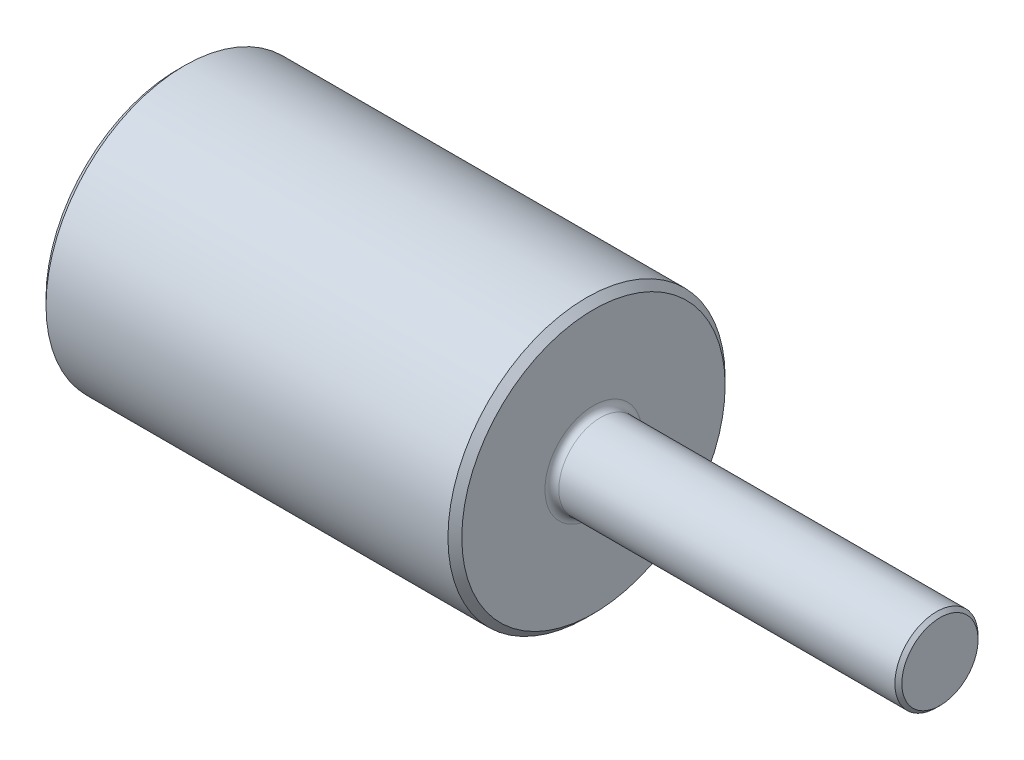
from build123d import *

# Parameters (mm, degrees)
CHANFREIN1_SIZE = 0.25
CHANFREIN3_SIZE = 0.5
CONG_1_R        = 0.5


with BuildPart() as part:
    # Esquisse1 → Base-R_volution (revolve)
    with BuildSketch(Plane.XY, mode=Mode.PRIVATE) as base_r_volution_sk:
        Polygon((0, 0), (0, 3), (-25, 3), (-25, 10), (-55, 10), (-55, 0), align=None)
    revolve(base_r_volution_sk.sketch.rotate(Axis((-58.669915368, 0, 0), (1, 0, 0)), 90), axis=Axis((-58.669915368, 0, 0), (1, 0, 0)))

    # Chanfrein1
    chanfrein1_edges = [part.edges().sort_by_distance(p)[0] for p in [
        (0, 0, -3),
    ]]
    chamfer(chanfrein1_edges, length=CHANFREIN1_SIZE)

    # Chanfrein3
    chanfrein3_edges = [part.edges().sort_by_distance(p)[0] for p in [
        (-25, 0, -10),
        (-55, 0, -10),
    ]]
    chamfer(chanfrein3_edges, length=CHANFREIN3_SIZE)

    # Cong_1
    cong_1_edges = [part.edges().sort_by_distance(p)[0] for p in [
        (-25, 0, -3),
    ]]
    fillet(cong_1_edges, radius=CONG_1_R)


solid = part.part
